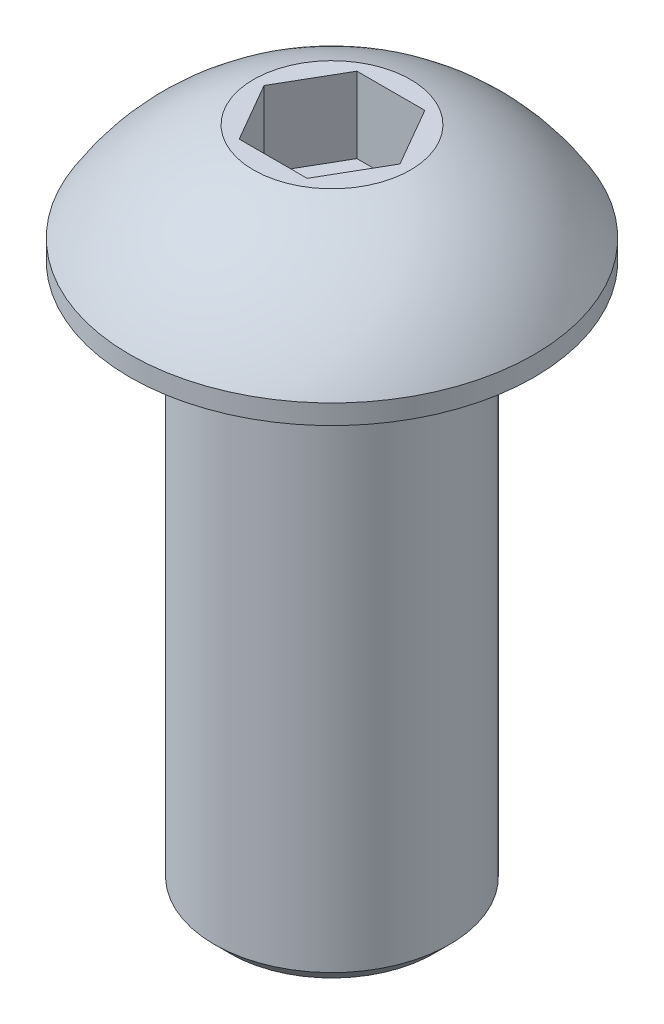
ISO-10303-21;
HEADER;
FILE_DESCRIPTION(('STEP AP214'),'2;1');
FILE_NAME('part.step','',(''),(''),'','','');
FILE_SCHEMA(('AUTOMOTIVE_DESIGN { 1 0 10303 214 1 1 1 1 }'));
ENDSEC;
DATA;
#1=APPLICATION_CONTEXT('core data for automotive mechanical design processes');
#2=APPLICATION_PROTOCOL_DEFINITION('international standard','automotive_design',2000,#1);
#3=PRODUCT_CONTEXT('',#1,'mechanical');
#4=PRODUCT('Part','Part','',(#3));
#5=PRODUCT_RELATED_PRODUCT_CATEGORY('part','',(#4));
#6=PRODUCT_DEFINITION_FORMATION('','',#4);
#7=PRODUCT_DEFINITION_CONTEXT('part definition',#1,'design');
#8=PRODUCT_DEFINITION('design','',#6,#7);
#9=PRODUCT_DEFINITION_SHAPE('','',#8);
#10=(LENGTH_UNIT() NAMED_UNIT(*) SI_UNIT(.MILLI.,.METRE.));
#11=(NAMED_UNIT(*) PLANE_ANGLE_UNIT() SI_UNIT($,.RADIAN.));
#12=(NAMED_UNIT(*) SI_UNIT($,.STERADIAN.) SOLID_ANGLE_UNIT());
#13=UNCERTAINTY_MEASURE_WITH_UNIT(LENGTH_MEASURE(1.E-05),#10,'distance_accuracy_value','');
#14=(GEOMETRIC_REPRESENTATION_CONTEXT(3) GLOBAL_UNCERTAINTY_ASSIGNED_CONTEXT((#13)) GLOBAL_UNIT_ASSIGNED_CONTEXT((#10,
#11,#12)) REPRESENTATION_CONTEXT('',''));
#15=CARTESIAN_POINT('',(0.,0.,0.));
#16=DIRECTION('',(0.,0.,1.));
#17=DIRECTION('',(1.,0.,0.));
#18=AXIS2_PLACEMENT_3D('',#15,#16,#17);
#19=CARTESIAN_POINT('',(5.15,0.,0.));
#20=DIRECTION('',(0.,1.,0.));
#21=DIRECTION('',(0.,0.,1.));
#22=AXIS2_PLACEMENT_3D('',#19,#20,#21);
#23=PLANE('',#22);
#24=CARTESIAN_POINT('',(0.,0.,0.));
#25=DIRECTION('',(0.,1.,0.));
#26=DIRECTION('',(0.,0.,1.));
#27=AXIS2_PLACEMENT_3D('',#24,#25,#26);
#28=CIRCLE('',#27,3.4572);
#29=CARTESIAN_POINT('',(0.,0.,3.4572));
#30=VERTEX_POINT('',#29);
#31=EDGE_CURVE('E152',#30,#30,#28,.T.);
#32=ORIENTED_EDGE('',*,*,#31,.T.);
#33=EDGE_LOOP('',(#32));
#34=FACE_BOUND('',#33,.T.);
#35=CARTESIAN_POINT('',(0.,0.,0.));
#36=DIRECTION('',(0.,1.,0.));
#37=DIRECTION('',(0.,0.,1.));
#38=AXIS2_PLACEMENT_3D('',#35,#36,#37);
#39=CIRCLE('',#38,5.15);
#40=CARTESIAN_POINT('',(0.,0.,5.15));
#41=VERTEX_POINT('',#40);
#42=EDGE_CURVE('E134',#41,#41,#39,.T.);
#43=ORIENTED_EDGE('',*,*,#42,.F.);
#44=EDGE_LOOP('',(#43));
#45=FACE_BOUND('',#44,.T.);
#46=ADVANCED_FACE('F32',(#34,#45),#23,.F.);
#47=CARTESIAN_POINT('',(0.,3.,0.));
#48=DIRECTION('',(0.,-1.,0.));
#49=DIRECTION('',(0.,0.,-1.));
#50=AXIS2_PLACEMENT_3D('',#47,#48,#49);
#51=PLANE('',#50);
#52=DIRECTION('',(-0.5,0.,0.866025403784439));
#53=VECTOR('',#52,1.);
#54=CARTESIAN_POINT('',(-0.866025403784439,3.,-1.5));
#55=LINE('',#54,#53);
#56=CARTESIAN_POINT('',(-0.866025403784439,3.,-1.5));
#57=VERTEX_POINT('',#56);
#58=CARTESIAN_POINT('',(-1.73205080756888,3.,0.));
#59=VERTEX_POINT('',#58);
#60=EDGE_CURVE('E101',#57,#59,#55,.T.);
#61=ORIENTED_EDGE('',*,*,#60,.F.);
#62=DIRECTION('',(-1.,0.,0.));
#63=VECTOR('',#62,1.);
#64=CARTESIAN_POINT('',(0.866025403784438,3.,-1.5));
#65=LINE('',#64,#63);
#66=CARTESIAN_POINT('',(0.866025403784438,3.,-1.5));
#67=VERTEX_POINT('',#66);
#68=EDGE_CURVE('E47',#67,#57,#65,.T.);
#69=ORIENTED_EDGE('',*,*,#68,.F.);
#70=DIRECTION('',(-0.5,0.,-0.866025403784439));
#71=VECTOR('',#70,1.);
#72=CARTESIAN_POINT('',(1.73205080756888,3.,0.));
#73=LINE('',#72,#71);
#74=CARTESIAN_POINT('',(1.73205080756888,3.,0.));
#75=VERTEX_POINT('',#74);
#76=EDGE_CURVE('E116',#75,#67,#73,.T.);
#77=ORIENTED_EDGE('',*,*,#76,.F.);
#78=DIRECTION('',(0.5,0.,-0.866025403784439));
#79=VECTOR('',#78,1.);
#80=CARTESIAN_POINT('',(0.866025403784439,3.,1.5));
#81=LINE('',#80,#79);
#82=CARTESIAN_POINT('',(0.866025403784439,3.,1.5));
#83=VERTEX_POINT('',#82);
#84=EDGE_CURVE('E110',#83,#75,#81,.T.);
#85=ORIENTED_EDGE('',*,*,#84,.F.);
#86=DIRECTION('',(1.,0.,0.));
#87=VECTOR('',#86,1.);
#88=CARTESIAN_POINT('',(-0.866025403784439,3.,1.5));
#89=LINE('',#88,#87);
#90=CARTESIAN_POINT('',(-0.866025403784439,3.,1.5));
#91=VERTEX_POINT('',#90);
#92=EDGE_CURVE('E108',#91,#83,#89,.T.);
#93=ORIENTED_EDGE('',*,*,#92,.F.);
#94=DIRECTION('',(0.5,0.,0.866025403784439));
#95=VECTOR('',#94,1.);
#96=CARTESIAN_POINT('',(-1.73205080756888,3.,0.));
#97=LINE('',#96,#95);
#98=EDGE_CURVE('E90',#59,#91,#97,.T.);
#99=ORIENTED_EDGE('',*,*,#98,.F.);
#100=EDGE_LOOP('',(#61,#69,#77,#85,#93,#99));
#101=FACE_BOUND('',#100,.T.);
#102=CARTESIAN_POINT('',(0.,3.,0.));
#103=DIRECTION('',(0.,1.,0.));
#104=DIRECTION('',(0.,0.,1.));
#105=AXIS2_PLACEMENT_3D('',#102,#103,#104);
#106=CIRCLE('',#105,2.);
#107=CARTESIAN_POINT('',(0.,3.,2.));
#108=VERTEX_POINT('',#107);
#109=EDGE_CURVE('E146',#108,#108,#106,.T.);
#110=ORIENTED_EDGE('',*,*,#109,.T.);
#111=EDGE_LOOP('',(#110));
#112=FACE_BOUND('',#111,.T.);
#113=ADVANCED_FACE('F34',(#101,#112),#51,.F.);
#114=CARTESIAN_POINT('',(0.,-2.39568540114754,0.));
#115=DIRECTION('',(0.,1.,0.));
#116=DIRECTION('',(0.,0.,1.));
#117=AXIS2_PLACEMENT_3D('',#114,#115,#116);
#118=DEGENERATE_TOROIDAL_SURFACE('',#117,0.284773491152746,5.66175087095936,.T.);
#119=ORIENTED_EDGE('',*,*,#109,.F.);
#120=EDGE_LOOP('',(#119));
#121=FACE_BOUND('',#120,.T.);
#122=CARTESIAN_POINT('',(0.,0.5,0.));
#123=DIRECTION('',(0.,1.,0.));
#124=DIRECTION('',(0.,0.,1.));
#125=AXIS2_PLACEMENT_3D('',#122,#123,#124);
#126=CIRCLE('',#125,5.15);
#127=CARTESIAN_POINT('',(0.,0.5,5.15));
#128=VERTEX_POINT('',#127);
#129=EDGE_CURVE('E143',#128,#128,#126,.T.);
#130=ORIENTED_EDGE('',*,*,#129,.T.);
#131=EDGE_LOOP('',(#130));
#132=FACE_BOUND('',#131,.T.);
#133=ADVANCED_FACE('F176',(#121,#132),#118,.T.);
#134=CARTESIAN_POINT('',(0.,2.46413420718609,0.));
#135=DIRECTION('',(0.,1.,0.));
#136=DIRECTION('',(0.,0.,1.));
#137=AXIS2_PLACEMENT_3D('',#134,#135,#136);
#138=CYLINDRICAL_SURFACE('',#137,5.15);
#139=ORIENTED_EDGE('',*,*,#129,.F.);
#140=EDGE_LOOP('',(#139));
#141=FACE_BOUND('',#140,.T.);
#142=ORIENTED_EDGE('',*,*,#42,.T.);
#143=EDGE_LOOP('',(#142));
#144=FACE_BOUND('',#143,.T.);
#145=ADVANCED_FACE('F182',(#141,#144),#138,.T.);
#146=CARTESIAN_POINT('',(0.866025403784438,1.0696,-1.5));
#147=DIRECTION('',(0.,0.,-1.));
#148=DIRECTION('',(-1.,0.,0.));
#149=AXIS2_PLACEMENT_3D('',#146,#147,#148);
#150=PLANE('',#149);
#151=ORIENTED_EDGE('',*,*,#68,.T.);
#152=DIRECTION('',(0.,1.,0.));
#153=VECTOR('',#152,1.);
#154=CARTESIAN_POINT('',(-0.866025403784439,1.0696,-1.5));
#155=LINE('',#154,#153);
#156=CARTESIAN_POINT('',(-0.866025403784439,1.0696,-1.5));
#157=VERTEX_POINT('',#156);
#158=EDGE_CURVE('E98',#157,#57,#155,.T.);
#159=ORIENTED_EDGE('',*,*,#158,.F.);
#160=DIRECTION('',(-1.,0.,0.));
#161=VECTOR('',#160,1.);
#162=CARTESIAN_POINT('',(0.866025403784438,1.0696,-1.5));
#163=LINE('',#162,#161);
#164=CARTESIAN_POINT('',(0.866025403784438,1.0696,-1.5));
#165=VERTEX_POINT('',#164);
#166=EDGE_CURVE('E118',#165,#157,#163,.T.);
#167=ORIENTED_EDGE('',*,*,#166,.F.);
#168=DIRECTION('',(0.,1.,0.));
#169=VECTOR('',#168,1.);
#170=CARTESIAN_POINT('',(0.866025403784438,1.0696,-1.5));
#171=LINE('',#170,#169);
#172=EDGE_CURVE('E54',#165,#67,#171,.T.);
#173=ORIENTED_EDGE('',*,*,#172,.T.);
#174=EDGE_LOOP('',(#151,#159,#167,#173));
#175=FACE_BOUND('',#174,.T.);
#176=ADVANCED_FACE('F180',(#175),#150,.F.);
#177=CARTESIAN_POINT('',(1.73205080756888,1.0696,0.));
#178=DIRECTION('',(0.866025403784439,0.,-0.5));
#179=DIRECTION('',(-0.5,0.,-0.866025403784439));
#180=AXIS2_PLACEMENT_3D('',#177,#178,#179);
#181=PLANE('',#180);
#182=ORIENTED_EDGE('',*,*,#76,.T.);
#183=ORIENTED_EDGE('',*,*,#172,.F.);
#184=DIRECTION('',(-0.5,0.,-0.866025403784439));
#185=VECTOR('',#184,1.);
#186=CARTESIAN_POINT('',(1.73205080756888,1.0696,0.));
#187=LINE('',#186,#185);
#188=CARTESIAN_POINT('',(1.73205080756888,1.0696,0.));
#189=VERTEX_POINT('',#188);
#190=EDGE_CURVE('E130',#189,#165,#187,.T.);
#191=ORIENTED_EDGE('',*,*,#190,.F.);
#192=DIRECTION('',(0.,1.,0.));
#193=VECTOR('',#192,1.);
#194=CARTESIAN_POINT('',(1.73205080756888,1.0696,0.));
#195=LINE('',#194,#193);
#196=EDGE_CURVE('E135',#189,#75,#195,.T.);
#197=ORIENTED_EDGE('',*,*,#196,.T.);
#198=EDGE_LOOP('',(#182,#183,#191,#197));
#199=FACE_BOUND('',#198,.T.);
#200=ADVANCED_FACE('F206',(#199),#181,.F.);
#201=CARTESIAN_POINT('',(0.866025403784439,1.0696,1.5));
#202=DIRECTION('',(0.866025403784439,0.,0.5));
#203=DIRECTION('',(0.5,0.,-0.866025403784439));
#204=AXIS2_PLACEMENT_3D('',#201,#202,#203);
#205=PLANE('',#204);
#206=ORIENTED_EDGE('',*,*,#84,.T.);
#207=ORIENTED_EDGE('',*,*,#196,.F.);
#208=DIRECTION('',(0.5,0.,-0.866025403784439));
#209=VECTOR('',#208,1.);
#210=CARTESIAN_POINT('',(0.866025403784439,1.0696,1.5));
#211=LINE('',#210,#209);
#212=CARTESIAN_POINT('',(0.866025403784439,1.0696,1.5));
#213=VERTEX_POINT('',#212);
#214=EDGE_CURVE('E127',#213,#189,#211,.T.);
#215=ORIENTED_EDGE('',*,*,#214,.F.);
#216=DIRECTION('',(0.,1.,0.));
#217=VECTOR('',#216,1.);
#218=CARTESIAN_POINT('',(0.866025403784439,1.0696,1.5));
#219=LINE('',#218,#217);
#220=EDGE_CURVE('E137',#213,#83,#219,.T.);
#221=ORIENTED_EDGE('',*,*,#220,.T.);
#222=EDGE_LOOP('',(#206,#207,#215,#221));
#223=FACE_BOUND('',#222,.T.);
#224=ADVANCED_FACE('F212',(#223),#205,.F.);
#225=CARTESIAN_POINT('',(-0.866025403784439,1.0696,1.5));
#226=DIRECTION('',(0.,0.,1.));
#227=DIRECTION('',(1.,0.,0.));
#228=AXIS2_PLACEMENT_3D('',#225,#226,#227);
#229=PLANE('',#228);
#230=ORIENTED_EDGE('',*,*,#92,.T.);
#231=ORIENTED_EDGE('',*,*,#220,.F.);
#232=DIRECTION('',(1.,0.,0.));
#233=VECTOR('',#232,1.);
#234=CARTESIAN_POINT('',(-0.866025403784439,1.0696,1.5));
#235=LINE('',#234,#233);
#236=CARTESIAN_POINT('',(-0.866025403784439,1.0696,1.5));
#237=VERTEX_POINT('',#236);
#238=EDGE_CURVE('E124',#237,#213,#235,.T.);
#239=ORIENTED_EDGE('',*,*,#238,.F.);
#240=DIRECTION('',(0.,1.,0.));
#241=VECTOR('',#240,1.);
#242=CARTESIAN_POINT('',(-0.866025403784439,1.0696,1.5));
#243=LINE('',#242,#241);
#244=EDGE_CURVE('E97',#237,#91,#243,.T.);
#245=ORIENTED_EDGE('',*,*,#244,.T.);
#246=EDGE_LOOP('',(#230,#231,#239,#245));
#247=FACE_BOUND('',#246,.T.);
#248=ADVANCED_FACE('F219',(#247),#229,.F.);
#249=CARTESIAN_POINT('',(-1.73205080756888,1.0696,0.));
#250=DIRECTION('',(-0.866025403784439,0.,0.5));
#251=DIRECTION('',(0.5,0.,0.866025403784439));
#252=AXIS2_PLACEMENT_3D('',#249,#250,#251);
#253=PLANE('',#252);
#254=ORIENTED_EDGE('',*,*,#98,.T.);
#255=ORIENTED_EDGE('',*,*,#244,.F.);
#256=DIRECTION('',(0.5,0.,0.866025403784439));
#257=VECTOR('',#256,1.);
#258=CARTESIAN_POINT('',(-1.73205080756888,1.0696,0.));
#259=LINE('',#258,#257);
#260=CARTESIAN_POINT('',(-1.73205080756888,1.0696,0.));
#261=VERTEX_POINT('',#260);
#262=EDGE_CURVE('E93',#261,#237,#259,.T.);
#263=ORIENTED_EDGE('',*,*,#262,.F.);
#264=DIRECTION('',(0.,1.,0.));
#265=VECTOR('',#264,1.);
#266=CARTESIAN_POINT('',(-1.73205080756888,1.0696,0.));
#267=LINE('',#266,#265);
#268=EDGE_CURVE('E86',#261,#59,#267,.T.);
#269=ORIENTED_EDGE('',*,*,#268,.T.);
#270=EDGE_LOOP('',(#254,#255,#263,#269));
#271=FACE_BOUND('',#270,.T.);
#272=ADVANCED_FACE('F88',(#271),#253,.F.);
#273=CARTESIAN_POINT('',(-0.866025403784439,1.0696,-1.5));
#274=DIRECTION('',(-0.866025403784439,0.,-0.5));
#275=DIRECTION('',(-0.5,0.,0.866025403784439));
#276=AXIS2_PLACEMENT_3D('',#273,#274,#275);
#277=PLANE('',#276);
#278=ORIENTED_EDGE('',*,*,#60,.T.);
#279=ORIENTED_EDGE('',*,*,#268,.F.);
#280=DIRECTION('',(-0.5,0.,0.866025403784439));
#281=VECTOR('',#280,1.);
#282=CARTESIAN_POINT('',(-0.866025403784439,1.0696,-1.5));
#283=LINE('',#282,#281);
#284=EDGE_CURVE('E121',#157,#261,#283,.T.);
#285=ORIENTED_EDGE('',*,*,#284,.F.);
#286=ORIENTED_EDGE('',*,*,#158,.T.);
#287=EDGE_LOOP('',(#278,#279,#285,#286));
#288=FACE_BOUND('',#287,.T.);
#289=ADVANCED_FACE('F102',(#288),#277,.F.);
#290=CARTESIAN_POINT('',(-0.866025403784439,1.0696,-1.5));
#291=DIRECTION('',(0.,1.,0.));
#292=DIRECTION('',(0.,0.,1.));
#293=AXIS2_PLACEMENT_3D('',#290,#291,#292);
#294=PLANE('',#293);
#295=ORIENTED_EDGE('',*,*,#166,.T.);
#296=ORIENTED_EDGE('',*,*,#284,.T.);
#297=ORIENTED_EDGE('',*,*,#262,.T.);
#298=ORIENTED_EDGE('',*,*,#238,.T.);
#299=ORIENTED_EDGE('',*,*,#214,.T.);
#300=ORIENTED_EDGE('',*,*,#190,.T.);
#301=EDGE_LOOP('',(#295,#296,#297,#298,#299,#300));
#302=FACE_BOUND('',#301,.T.);
#303=ADVANCED_FACE('F240',(#302),#294,.T.);
#304=CARTESIAN_POINT('',(0.,-14.,0.));
#305=DIRECTION('',(0.,1.,0.));
#306=DIRECTION('',(0.,0.,1.));
#307=AXIS2_PLACEMENT_3D('',#304,#305,#306);
#308=CYLINDRICAL_SURFACE('',#307,3.);
#309=CARTESIAN_POINT('',(0.,-13.5936,0.));
#310=DIRECTION('',(0.,-1.,0.));
#311=DIRECTION('',(0.,0.,-1.));
#312=AXIS2_PLACEMENT_3D('',#309,#310,#311);
#313=CIRCLE('',#312,3.);
#314=CARTESIAN_POINT('',(0.,-13.5936,-3.));
#315=VERTEX_POINT('',#314);
#316=EDGE_CURVE('E11',#315,#315,#313,.F.);
#317=ORIENTED_EDGE('',*,*,#316,.T.);
#318=EDGE_LOOP('',(#317));
#319=FACE_BOUND('',#318,.T.);
#320=CARTESIAN_POINT('',(0.,-0.4572,0.));
#321=DIRECTION('',(0.,1.,0.));
#322=DIRECTION('',(0.,0.,1.));
#323=AXIS2_PLACEMENT_3D('',#320,#321,#322);
#324=CIRCLE('',#323,3.);
#325=CARTESIAN_POINT('',(0.,-0.4572,3.));
#326=VERTEX_POINT('',#325);
#327=EDGE_CURVE('E149',#326,#326,#324,.F.);
#328=ORIENTED_EDGE('',*,*,#327,.T.);
#329=EDGE_LOOP('',(#328));
#330=FACE_BOUND('',#329,.T.);
#331=ADVANCED_FACE('F246',(#319,#330),#308,.T.);
#332=CARTESIAN_POINT('',(0.,-14.,0.));
#333=DIRECTION('',(0.,-1.,0.));
#334=DIRECTION('',(0.,0.,-1.));
#335=AXIS2_PLACEMENT_3D('',#332,#333,#334);
#336=PLANE('',#335);
#337=CARTESIAN_POINT('',(0.,-14.,0.));
#338=DIRECTION('',(0.,-1.,0.));
#339=DIRECTION('',(0.,0.,-1.));
#340=AXIS2_PLACEMENT_3D('',#337,#338,#339);
#341=CIRCLE('',#340,2.5936);
#342=CARTESIAN_POINT('',(0.,-14.,-2.5936));
#343=VERTEX_POINT('',#342);
#344=EDGE_CURVE('E40',#343,#343,#341,.T.);
#345=ORIENTED_EDGE('',*,*,#344,.T.);
#346=EDGE_LOOP('',(#345));
#347=FACE_BOUND('',#346,.T.);
#348=ADVANCED_FACE('F157',(#347),#336,.T.);
#349=CARTESIAN_POINT('',(0.,-0.4572,0.));
#350=DIRECTION('',(0.,1.,0.));
#351=DIRECTION('',(0.,0.,1.));
#352=AXIS2_PLACEMENT_3D('',#349,#350,#351);
#353=TOROIDAL_SURFACE('',#352,3.4572,0.4572);
#354=ORIENTED_EDGE('',*,*,#31,.F.);
#355=EDGE_LOOP('',(#354));
#356=FACE_BOUND('',#355,.T.);
#357=ORIENTED_EDGE('',*,*,#327,.F.);
#358=EDGE_LOOP('',(#357));
#359=FACE_BOUND('',#358,.T.);
#360=ADVANCED_FACE('F161',(#356,#359),#353,.F.);
#361=CARTESIAN_POINT('',(0.,-14.,0.));
#362=DIRECTION('',(0.,1.,0.));
#363=DIRECTION('',(0.,0.,1.));
#364=AXIS2_PLACEMENT_3D('',#361,#362,#363);
#365=CONICAL_SURFACE('',#364,2.5936,0.785398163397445);
#366=ORIENTED_EDGE('',*,*,#316,.F.);
#367=EDGE_LOOP('',(#366));
#368=FACE_BOUND('',#367,.T.);
#369=ORIENTED_EDGE('',*,*,#344,.F.);
#370=EDGE_LOOP('',(#369));
#371=FACE_BOUND('',#370,.T.);
#372=ADVANCED_FACE('F159',(#368,#371),#365,.T.);
#373=CLOSED_SHELL('',(#46,#113,#133,#145,#176,#200,#224,#248,#272,#289,#303,#331,#348,#360,#372));
#374=MANIFOLD_SOLID_BREP('B2',#373);
#375=ADVANCED_BREP_SHAPE_REPRESENTATION('',(#18,#374),#14);
#376=SHAPE_DEFINITION_REPRESENTATION(#9,#375);
ENDSEC;
END-ISO-10303-21;
